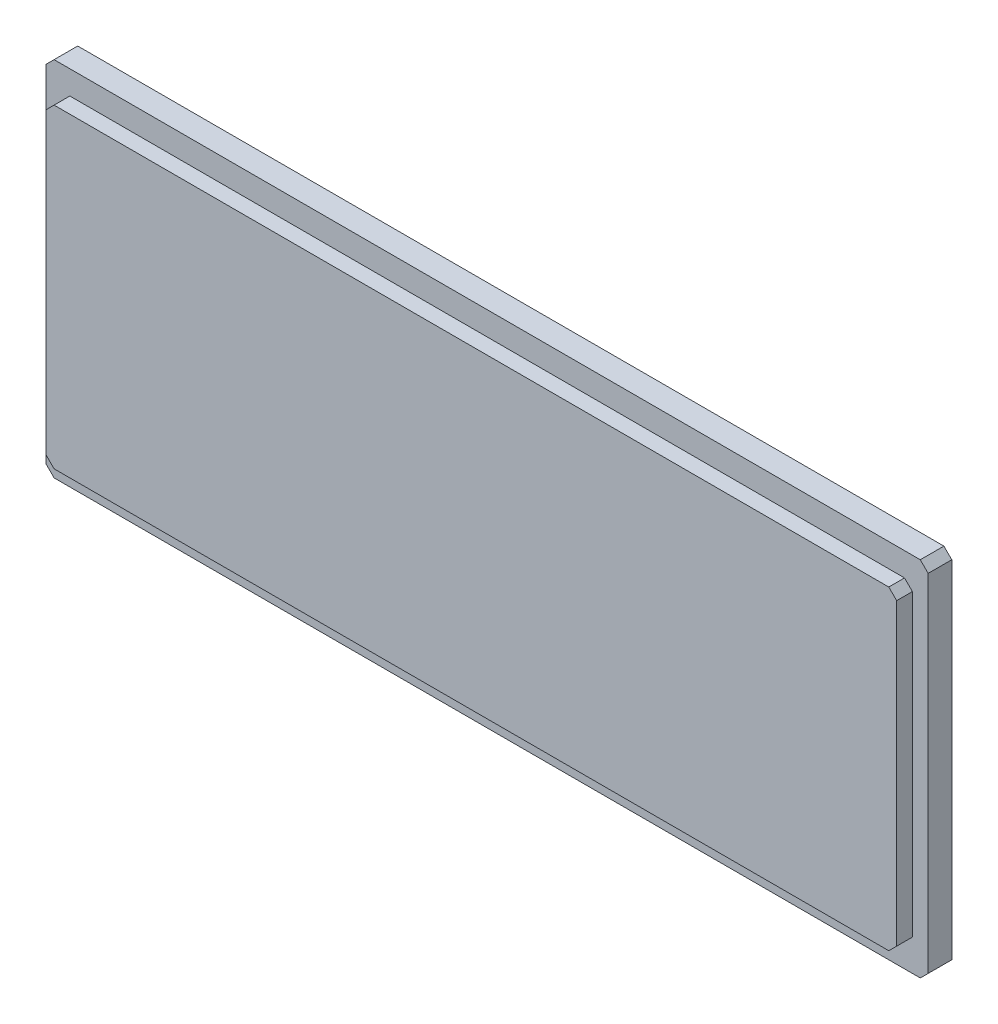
ISO-10303-21;
HEADER;
FILE_DESCRIPTION(('STEP AP214'),'2;1');
FILE_NAME('part.step','',(''),(''),'','','');
FILE_SCHEMA(('AUTOMOTIVE_DESIGN { 1 0 10303 214 1 1 1 1 }'));
ENDSEC;
DATA;
#1=APPLICATION_CONTEXT('core data for automotive mechanical design processes');
#2=APPLICATION_PROTOCOL_DEFINITION('international standard','automotive_design',2000,#1);
#3=PRODUCT_CONTEXT('',#1,'mechanical');
#4=PRODUCT('Part','Part','',(#3));
#5=PRODUCT_RELATED_PRODUCT_CATEGORY('part','',(#4));
#6=PRODUCT_DEFINITION_FORMATION('','',#4);
#7=PRODUCT_DEFINITION_CONTEXT('part definition',#1,'design');
#8=PRODUCT_DEFINITION('design','',#6,#7);
#9=PRODUCT_DEFINITION_SHAPE('','',#8);
#10=(LENGTH_UNIT() NAMED_UNIT(*) SI_UNIT(.MILLI.,.METRE.));
#11=(NAMED_UNIT(*) PLANE_ANGLE_UNIT() SI_UNIT($,.RADIAN.));
#12=(NAMED_UNIT(*) SI_UNIT($,.STERADIAN.) SOLID_ANGLE_UNIT());
#13=UNCERTAINTY_MEASURE_WITH_UNIT(LENGTH_MEASURE(1.E-05),#10,'distance_accuracy_value','');
#14=(GEOMETRIC_REPRESENTATION_CONTEXT(3) GLOBAL_UNCERTAINTY_ASSIGNED_CONTEXT((#13)) GLOBAL_UNIT_ASSIGNED_CONTEXT((#10,
#11,#12)) REPRESENTATION_CONTEXT('',''));
#15=CARTESIAN_POINT('',(0.,0.,0.));
#16=DIRECTION('',(0.,0.,1.));
#17=DIRECTION('',(1.,0.,0.));
#18=AXIS2_PLACEMENT_3D('',#15,#16,#17);
#19=CARTESIAN_POINT('',(-41.,40.,1.5));
#20=DIRECTION('',(0.,0.,1.));
#21=DIRECTION('',(1.,0.,0.));
#22=AXIS2_PLACEMENT_3D('',#19,#20,#21);
#23=PLANE('',#22);
#24=DIRECTION('',(-1.,0.,0.));
#25=VECTOR('',#24,1.);
#26=CARTESIAN_POINT('',(-41.,40.,1.5));
#27=LINE('',#26,#25);
#28=CARTESIAN_POINT('',(14.5,40.,1.5));
#29=VERTEX_POINT('',#28);
#30=CARTESIAN_POINT('',(-40.5,40.,1.5));
#31=VERTEX_POINT('',#30);
#32=EDGE_CURVE('E172',#29,#31,#27,.T.);
#33=ORIENTED_EDGE('',*,*,#32,.T.);
#34=DIRECTION('',(0.707106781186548,0.707106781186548,0.));
#35=VECTOR('',#34,1.);
#36=CARTESIAN_POINT('',(-40.75,39.75,1.5));
#37=LINE('',#36,#35);
#38=CARTESIAN_POINT('',(-41.,39.5,1.5));
#39=VERTEX_POINT('',#38);
#40=EDGE_CURVE('E224',#31,#39,#37,.F.);
#41=ORIENTED_EDGE('',*,*,#40,.T.);
#42=DIRECTION('',(0.,-1.,0.));
#43=VECTOR('',#42,1.);
#44=CARTESIAN_POINT('',(-41.,40.,1.5));
#45=LINE('',#44,#43);
#46=CARTESIAN_POINT('',(-41.,17.5,1.5));
#47=VERTEX_POINT('',#46);
#48=EDGE_CURVE('E189',#39,#47,#45,.T.);
#49=ORIENTED_EDGE('',*,*,#48,.T.);
#50=DIRECTION('',(-0.707106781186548,0.707106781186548,0.));
#51=VECTOR('',#50,1.);
#52=CARTESIAN_POINT('',(-52.25,28.75,1.5));
#53=LINE('',#52,#51);
#54=CARTESIAN_POINT('',(-40.5,17.,1.5));
#55=VERTEX_POINT('',#54);
#56=EDGE_CURVE('E198',#47,#55,#53,.F.);
#57=ORIENTED_EDGE('',*,*,#56,.T.);
#58=DIRECTION('',(1.,0.,0.));
#59=VECTOR('',#58,1.);
#60=CARTESIAN_POINT('',(-41.,17.,1.5));
#61=LINE('',#60,#59);
#62=CARTESIAN_POINT('',(14.5,17.,1.5));
#63=VERTEX_POINT('',#62);
#64=EDGE_CURVE('E171',#55,#63,#61,.T.);
#65=ORIENTED_EDGE('',*,*,#64,.T.);
#66=DIRECTION('',(-0.707106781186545,-0.70710678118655,0.));
#67=VECTOR('',#66,1.);
#68=CARTESIAN_POINT('',(-1.74999999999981,0.750000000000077,1.5));
#69=LINE('',#68,#67);
#70=CARTESIAN_POINT('',(15.,17.5,1.5));
#71=VERTEX_POINT('',#70);
#72=EDGE_CURVE('E206',#63,#71,#69,.F.);
#73=ORIENTED_EDGE('',*,*,#72,.T.);
#74=DIRECTION('',(0.,1.,0.));
#75=VECTOR('',#74,1.);
#76=CARTESIAN_POINT('',(15.,40.,1.5));
#77=LINE('',#76,#75);
#78=CARTESIAN_POINT('',(15.,39.5,1.5));
#79=VERTEX_POINT('',#78);
#80=EDGE_CURVE('E192',#71,#79,#77,.T.);
#81=ORIENTED_EDGE('',*,*,#80,.T.);
#82=DIRECTION('',(0.707106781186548,-0.707106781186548,0.));
#83=VECTOR('',#82,1.);
#84=CARTESIAN_POINT('',(-13.25,67.75,1.5));
#85=LINE('',#84,#83);
#86=EDGE_CURVE('E215',#79,#29,#85,.F.);
#87=ORIENTED_EDGE('',*,*,#86,.T.);
#88=EDGE_LOOP('',(#33,#41,#49,#57,#65,#73,#81,#87));
#89=FACE_BOUND('',#88,.T.);
#90=DIRECTION('',(1.,0.,0.));
#91=VECTOR('',#90,1.);
#92=CARTESIAN_POINT('',(-40.,18.5,1.5));
#93=LINE('',#92,#91);
#94=CARTESIAN_POINT('',(-39.5,18.5,1.5));
#95=VERTEX_POINT('',#94);
#96=CARTESIAN_POINT('',(13.5,18.5,1.5));
#97=VERTEX_POINT('',#96);
#98=EDGE_CURVE('E375',#95,#97,#93,.T.);
#99=ORIENTED_EDGE('',*,*,#98,.F.);
#100=DIRECTION('',(0.707106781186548,-0.707106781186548,0.));
#101=VECTOR('',#100,1.);
#102=CARTESIAN_POINT('',(-39.5,18.5,1.5));
#103=LINE('',#102,#101);
#104=CARTESIAN_POINT('',(-40.,19.,1.5));
#105=VERTEX_POINT('',#104);
#106=EDGE_CURVE('E11',#95,#105,#103,.F.);
#107=ORIENTED_EDGE('',*,*,#106,.T.);
#108=DIRECTION('',(0.,-1.,0.));
#109=VECTOR('',#108,1.);
#110=CARTESIAN_POINT('',(-40.,38.5,1.5));
#111=LINE('',#110,#109);
#112=CARTESIAN_POINT('',(-40.,38.,1.5));
#113=VERTEX_POINT('',#112);
#114=EDGE_CURVE('E377',#113,#105,#111,.T.);
#115=ORIENTED_EDGE('',*,*,#114,.F.);
#116=DIRECTION('',(-0.707106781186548,-0.707106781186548,0.));
#117=VECTOR('',#116,1.);
#118=CARTESIAN_POINT('',(-40.,38.,1.5));
#119=LINE('',#118,#117);
#120=CARTESIAN_POINT('',(-39.5,38.5,1.5));
#121=VERTEX_POINT('',#120);
#122=EDGE_CURVE('E253',#113,#121,#119,.F.);
#123=ORIENTED_EDGE('',*,*,#122,.T.);
#124=DIRECTION('',(-1.,0.,0.));
#125=VECTOR('',#124,1.);
#126=CARTESIAN_POINT('',(-40.,38.5,1.5));
#127=LINE('',#126,#125);
#128=CARTESIAN_POINT('',(13.5,38.5,1.5));
#129=VERTEX_POINT('',#128);
#130=EDGE_CURVE('E370',#129,#121,#127,.T.);
#131=ORIENTED_EDGE('',*,*,#130,.F.);
#132=DIRECTION('',(-0.707106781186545,0.70710678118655,0.));
#133=VECTOR('',#132,1.);
#134=CARTESIAN_POINT('',(13.5,38.5,1.5));
#135=LINE('',#134,#133);
#136=CARTESIAN_POINT('',(14.,38.,1.5));
#137=VERTEX_POINT('',#136);
#138=EDGE_CURVE('E244',#129,#137,#135,.F.);
#139=ORIENTED_EDGE('',*,*,#138,.T.);
#140=DIRECTION('',(0.,1.,0.));
#141=VECTOR('',#140,1.);
#142=CARTESIAN_POINT('',(14.,38.5,1.5));
#143=LINE('',#142,#141);
#144=CARTESIAN_POINT('',(14.,19.,1.5));
#145=VERTEX_POINT('',#144);
#146=EDGE_CURVE('E372',#145,#137,#143,.T.);
#147=ORIENTED_EDGE('',*,*,#146,.F.);
#148=DIRECTION('',(0.707106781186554,0.707106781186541,0.));
#149=VECTOR('',#148,1.);
#150=CARTESIAN_POINT('',(14.,19.,1.5));
#151=LINE('',#150,#149);
#152=EDGE_CURVE('E234',#145,#97,#151,.F.);
#153=ORIENTED_EDGE('',*,*,#152,.T.);
#154=EDGE_LOOP('',(#99,#107,#115,#123,#131,#139,#147,#153));
#155=FACE_BOUND('',#154,.T.);
#156=ADVANCED_FACE('F39',(#89,#155),#23,.T.);
#157=CARTESIAN_POINT('',(-41.,40.,1.5));
#158=DIRECTION('',(1.,0.,0.));
#159=DIRECTION('',(0.,0.,-1.));
#160=AXIS2_PLACEMENT_3D('',#157,#158,#159);
#161=PLANE('',#160);
#162=ORIENTED_EDGE('',*,*,#48,.F.);
#163=DIRECTION('',(0.,0.,-1.));
#164=VECTOR('',#163,1.);
#165=CARTESIAN_POINT('',(-41.,39.5,1.5));
#166=LINE('',#165,#164);
#167=CARTESIAN_POINT('',(-41.,39.5,0.));
#168=VERTEX_POINT('',#167);
#169=EDGE_CURVE('E217',#39,#168,#166,.T.);
#170=ORIENTED_EDGE('',*,*,#169,.T.);
#171=DIRECTION('',(0.,-1.,0.));
#172=VECTOR('',#171,1.);
#173=CARTESIAN_POINT('',(-41.,40.,0.));
#174=LINE('',#173,#172);
#175=CARTESIAN_POINT('',(-41.,17.5,0.));
#176=VERTEX_POINT('',#175);
#177=EDGE_CURVE('E178',#168,#176,#174,.T.);
#178=ORIENTED_EDGE('',*,*,#177,.T.);
#179=DIRECTION('',(0.,0.,1.));
#180=VECTOR('',#179,1.);
#181=CARTESIAN_POINT('',(-41.,17.5,1.5));
#182=LINE('',#181,#180);
#183=EDGE_CURVE('E159',#176,#47,#182,.T.);
#184=ORIENTED_EDGE('',*,*,#183,.T.);
#185=EDGE_LOOP('',(#162,#170,#178,#184));
#186=FACE_BOUND('',#185,.T.);
#187=ADVANCED_FACE('F41',(#186),#161,.F.);
#188=CARTESIAN_POINT('',(-41.,17.,1.5));
#189=DIRECTION('',(0.,1.,0.));
#190=DIRECTION('',(-1.,0.,0.));
#191=AXIS2_PLACEMENT_3D('',#188,#189,#190);
#192=PLANE('',#191);
#193=DIRECTION('',(1.,0.,0.));
#194=VECTOR('',#193,1.);
#195=CARTESIAN_POINT('',(-41.,17.,0.));
#196=LINE('',#195,#194);
#197=CARTESIAN_POINT('',(-40.5,17.,0.));
#198=VERTEX_POINT('',#197);
#199=CARTESIAN_POINT('',(14.5,17.,0.));
#200=VERTEX_POINT('',#199);
#201=EDGE_CURVE('E168',#198,#200,#196,.T.);
#202=ORIENTED_EDGE('',*,*,#201,.T.);
#203=DIRECTION('',(0.,0.,1.));
#204=VECTOR('',#203,1.);
#205=CARTESIAN_POINT('',(14.5,17.,1.5));
#206=LINE('',#205,#204);
#207=EDGE_CURVE('E204',#200,#63,#206,.T.);
#208=ORIENTED_EDGE('',*,*,#207,.T.);
#209=ORIENTED_EDGE('',*,*,#64,.F.);
#210=DIRECTION('',(0.,0.,-1.));
#211=VECTOR('',#210,1.);
#212=CARTESIAN_POINT('',(-40.5,17.,1.5));
#213=LINE('',#212,#211);
#214=EDGE_CURVE('E157',#55,#198,#213,.T.);
#215=ORIENTED_EDGE('',*,*,#214,.T.);
#216=EDGE_LOOP('',(#202,#208,#209,#215));
#217=FACE_BOUND('',#216,.T.);
#218=ADVANCED_FACE('F167',(#217),#192,.F.);
#219=CARTESIAN_POINT('',(15.,40.,1.5));
#220=DIRECTION('',(-1.,0.,0.));
#221=DIRECTION('',(0.,-1.,0.));
#222=AXIS2_PLACEMENT_3D('',#219,#220,#221);
#223=PLANE('',#222);
#224=DIRECTION('',(0.,1.,0.));
#225=VECTOR('',#224,1.);
#226=CARTESIAN_POINT('',(15.,40.,0.));
#227=LINE('',#226,#225);
#228=CARTESIAN_POINT('',(15.,17.5,0.));
#229=VERTEX_POINT('',#228);
#230=CARTESIAN_POINT('',(15.,39.5,0.));
#231=VERTEX_POINT('',#230);
#232=EDGE_CURVE('E177',#229,#231,#227,.T.);
#233=ORIENTED_EDGE('',*,*,#232,.T.);
#234=DIRECTION('',(0.,0.,1.));
#235=VECTOR('',#234,1.);
#236=CARTESIAN_POINT('',(15.,39.5,1.5));
#237=LINE('',#236,#235);
#238=EDGE_CURVE('E213',#231,#79,#237,.T.);
#239=ORIENTED_EDGE('',*,*,#238,.T.);
#240=ORIENTED_EDGE('',*,*,#80,.F.);
#241=DIRECTION('',(0.,0.,-1.));
#242=VECTOR('',#241,1.);
#243=CARTESIAN_POINT('',(15.,17.5,1.5));
#244=LINE('',#243,#242);
#245=EDGE_CURVE('E200',#71,#229,#244,.T.);
#246=ORIENTED_EDGE('',*,*,#245,.T.);
#247=EDGE_LOOP('',(#233,#239,#240,#246));
#248=FACE_BOUND('',#247,.T.);
#249=ADVANCED_FACE('F297',(#248),#223,.F.);
#250=CARTESIAN_POINT('',(-41.,40.,1.5));
#251=DIRECTION('',(0.,-1.,0.));
#252=DIRECTION('',(0.,0.,-1.));
#253=AXIS2_PLACEMENT_3D('',#250,#251,#252);
#254=PLANE('',#253);
#255=DIRECTION('',(-1.,0.,0.));
#256=VECTOR('',#255,1.);
#257=CARTESIAN_POINT('',(-41.,40.,0.));
#258=LINE('',#257,#256);
#259=CARTESIAN_POINT('',(14.5,40.,0.));
#260=VERTEX_POINT('',#259);
#261=CARTESIAN_POINT('',(-40.5,40.,0.));
#262=VERTEX_POINT('',#261);
#263=EDGE_CURVE('E181',#260,#262,#258,.T.);
#264=ORIENTED_EDGE('',*,*,#263,.T.);
#265=DIRECTION('',(0.,0.,1.));
#266=VECTOR('',#265,1.);
#267=CARTESIAN_POINT('',(-40.5,40.,1.5));
#268=LINE('',#267,#266);
#269=EDGE_CURVE('E222',#262,#31,#268,.T.);
#270=ORIENTED_EDGE('',*,*,#269,.T.);
#271=ORIENTED_EDGE('',*,*,#32,.F.);
#272=DIRECTION('',(0.,0.,-1.));
#273=VECTOR('',#272,1.);
#274=CARTESIAN_POINT('',(14.5,40.,1.5));
#275=LINE('',#274,#273);
#276=EDGE_CURVE('E208',#29,#260,#275,.T.);
#277=ORIENTED_EDGE('',*,*,#276,.T.);
#278=EDGE_LOOP('',(#264,#270,#271,#277));
#279=FACE_BOUND('',#278,.T.);
#280=ADVANCED_FACE('F294',(#279),#254,.F.);
#281=CARTESIAN_POINT('',(-41.,40.,0.));
#282=DIRECTION('',(0.,0.,1.));
#283=DIRECTION('',(1.,0.,0.));
#284=AXIS2_PLACEMENT_3D('',#281,#282,#283);
#285=PLANE('',#284);
#286=ORIENTED_EDGE('',*,*,#177,.F.);
#287=DIRECTION('',(-0.707106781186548,-0.707106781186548,0.));
#288=VECTOR('',#287,1.);
#289=CARTESIAN_POINT('',(-41.,39.5,0.));
#290=LINE('',#289,#288);
#291=EDGE_CURVE('E220',#168,#262,#290,.F.);
#292=ORIENTED_EDGE('',*,*,#291,.T.);
#293=ORIENTED_EDGE('',*,*,#263,.F.);
#294=DIRECTION('',(-0.707106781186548,0.707106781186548,0.));
#295=VECTOR('',#294,1.);
#296=CARTESIAN_POINT('',(14.5,40.,0.));
#297=LINE('',#296,#295);
#298=EDGE_CURVE('E211',#260,#231,#297,.F.);
#299=ORIENTED_EDGE('',*,*,#298,.T.);
#300=ORIENTED_EDGE('',*,*,#232,.F.);
#301=DIRECTION('',(0.707106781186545,0.70710678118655,0.));
#302=VECTOR('',#301,1.);
#303=CARTESIAN_POINT('',(15.,17.5,0.));
#304=LINE('',#303,#302);
#305=EDGE_CURVE('E176',#229,#200,#304,.F.);
#306=ORIENTED_EDGE('',*,*,#305,.T.);
#307=ORIENTED_EDGE('',*,*,#201,.F.);
#308=DIRECTION('',(0.707106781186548,-0.707106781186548,0.));
#309=VECTOR('',#308,1.);
#310=CARTESIAN_POINT('',(-40.5,17.,0.));
#311=LINE('',#310,#309);
#312=EDGE_CURVE('E153',#198,#176,#311,.F.);
#313=ORIENTED_EDGE('',*,*,#312,.T.);
#314=EDGE_LOOP('',(#286,#292,#293,#299,#300,#306,#307,#313));
#315=FACE_BOUND('',#314,.T.);
#316=ADVANCED_FACE('F174',(#315),#285,.F.);
#317=CARTESIAN_POINT('',(-40.,38.5,2.5));
#318=DIRECTION('',(1.,0.,0.));
#319=DIRECTION('',(0.,0.,-1.));
#320=AXIS2_PLACEMENT_3D('',#317,#318,#319);
#321=PLANE('',#320);
#322=ORIENTED_EDGE('',*,*,#114,.T.);
#323=DIRECTION('',(0.,0.,1.));
#324=VECTOR('',#323,1.);
#325=CARTESIAN_POINT('',(-40.,19.,2.5));
#326=LINE('',#325,#324);
#327=CARTESIAN_POINT('',(-40.,19.,2.5));
#328=VERTEX_POINT('',#327);
#329=EDGE_CURVE('E59',#105,#328,#326,.T.);
#330=ORIENTED_EDGE('',*,*,#329,.T.);
#331=DIRECTION('',(0.,-1.,0.));
#332=VECTOR('',#331,1.);
#333=CARTESIAN_POINT('',(-40.,38.5,2.5));
#334=LINE('',#333,#332);
#335=CARTESIAN_POINT('',(-40.,38.,2.5));
#336=VERTEX_POINT('',#335);
#337=EDGE_CURVE('E263',#336,#328,#334,.T.);
#338=ORIENTED_EDGE('',*,*,#337,.F.);
#339=DIRECTION('',(0.,0.,-1.));
#340=VECTOR('',#339,1.);
#341=CARTESIAN_POINT('',(-40.,38.,2.5));
#342=LINE('',#341,#340);
#343=EDGE_CURVE('E246',#336,#113,#342,.T.);
#344=ORIENTED_EDGE('',*,*,#343,.T.);
#345=EDGE_LOOP('',(#322,#330,#338,#344));
#346=FACE_BOUND('',#345,.T.);
#347=ADVANCED_FACE('F314',(#346),#321,.F.);
#348=CARTESIAN_POINT('',(-40.,18.5,2.5));
#349=DIRECTION('',(0.,1.,0.));
#350=DIRECTION('',(0.,0.,1.));
#351=AXIS2_PLACEMENT_3D('',#348,#349,#350);
#352=PLANE('',#351);
#353=DIRECTION('',(1.,0.,0.));
#354=VECTOR('',#353,1.);
#355=CARTESIAN_POINT('',(-40.,18.5,2.5));
#356=LINE('',#355,#354);
#357=CARTESIAN_POINT('',(-39.5,18.5,2.5));
#358=VERTEX_POINT('',#357);
#359=CARTESIAN_POINT('',(13.5,18.5,2.5));
#360=VERTEX_POINT('',#359);
#361=EDGE_CURVE('E262',#358,#360,#356,.T.);
#362=ORIENTED_EDGE('',*,*,#361,.F.);
#363=DIRECTION('',(0.,0.,-1.));
#364=VECTOR('',#363,1.);
#365=CARTESIAN_POINT('',(-39.5,18.5,2.5));
#366=LINE('',#365,#364);
#367=EDGE_CURVE('E255',#358,#95,#366,.T.);
#368=ORIENTED_EDGE('',*,*,#367,.T.);
#369=ORIENTED_EDGE('',*,*,#98,.T.);
#370=DIRECTION('',(0.,0.,1.));
#371=VECTOR('',#370,1.);
#372=CARTESIAN_POINT('',(13.5,18.5,2.5));
#373=LINE('',#372,#371);
#374=EDGE_CURVE('E229',#97,#360,#373,.T.);
#375=ORIENTED_EDGE('',*,*,#374,.T.);
#376=EDGE_LOOP('',(#362,#368,#369,#375));
#377=FACE_BOUND('',#376,.T.);
#378=ADVANCED_FACE('F267',(#377),#352,.F.);
#379=CARTESIAN_POINT('',(14.,38.5,2.5));
#380=DIRECTION('',(-1.,0.,0.));
#381=DIRECTION('',(0.,-1.,0.));
#382=AXIS2_PLACEMENT_3D('',#379,#380,#381);
#383=PLANE('',#382);
#384=ORIENTED_EDGE('',*,*,#146,.T.);
#385=DIRECTION('',(0.,0.,1.));
#386=VECTOR('',#385,1.);
#387=CARTESIAN_POINT('',(14.,38.,2.5));
#388=LINE('',#387,#386);
#389=CARTESIAN_POINT('',(14.,38.,2.5));
#390=VERTEX_POINT('',#389);
#391=EDGE_CURVE('E240',#137,#390,#388,.T.);
#392=ORIENTED_EDGE('',*,*,#391,.T.);
#393=DIRECTION('',(0.,1.,0.));
#394=VECTOR('',#393,1.);
#395=CARTESIAN_POINT('',(14.,38.5,2.5));
#396=LINE('',#395,#394);
#397=CARTESIAN_POINT('',(14.,19.,2.5));
#398=VERTEX_POINT('',#397);
#399=EDGE_CURVE('E270',#398,#390,#396,.T.);
#400=ORIENTED_EDGE('',*,*,#399,.F.);
#401=DIRECTION('',(0.,0.,-1.));
#402=VECTOR('',#401,1.);
#403=CARTESIAN_POINT('',(14.,19.,2.5));
#404=LINE('',#403,#402);
#405=EDGE_CURVE('E226',#398,#145,#404,.T.);
#406=ORIENTED_EDGE('',*,*,#405,.T.);
#407=EDGE_LOOP('',(#384,#392,#400,#406));
#408=FACE_BOUND('',#407,.T.);
#409=ADVANCED_FACE('F322',(#408),#383,.F.);
#410=CARTESIAN_POINT('',(-40.,38.5,2.5));
#411=DIRECTION('',(0.,-1.,0.));
#412=DIRECTION('',(1.,0.,0.));
#413=AXIS2_PLACEMENT_3D('',#410,#411,#412);
#414=PLANE('',#413);
#415=ORIENTED_EDGE('',*,*,#130,.T.);
#416=DIRECTION('',(0.,0.,1.));
#417=VECTOR('',#416,1.);
#418=CARTESIAN_POINT('',(-39.5,38.5,2.5));
#419=LINE('',#418,#417);
#420=CARTESIAN_POINT('',(-39.5,38.5,2.5));
#421=VERTEX_POINT('',#420);
#422=EDGE_CURVE('E249',#121,#421,#419,.T.);
#423=ORIENTED_EDGE('',*,*,#422,.T.);
#424=DIRECTION('',(-1.,0.,0.));
#425=VECTOR('',#424,1.);
#426=CARTESIAN_POINT('',(-40.,38.5,2.5));
#427=LINE('',#426,#425);
#428=CARTESIAN_POINT('',(13.5,38.5,2.5));
#429=VERTEX_POINT('',#428);
#430=EDGE_CURVE('E183',#429,#421,#427,.T.);
#431=ORIENTED_EDGE('',*,*,#430,.F.);
#432=DIRECTION('',(0.,0.,-1.));
#433=VECTOR('',#432,1.);
#434=CARTESIAN_POINT('',(13.5,38.5,2.5));
#435=LINE('',#434,#433);
#436=EDGE_CURVE('E237',#429,#129,#435,.T.);
#437=ORIENTED_EDGE('',*,*,#436,.T.);
#438=EDGE_LOOP('',(#415,#423,#431,#437));
#439=FACE_BOUND('',#438,.T.);
#440=ADVANCED_FACE('F327',(#439),#414,.F.);
#441=CARTESIAN_POINT('',(-40.,18.5,2.5));
#442=DIRECTION('',(0.,0.,1.));
#443=DIRECTION('',(1.,0.,0.));
#444=AXIS2_PLACEMENT_3D('',#441,#442,#443);
#445=PLANE('',#444);
#446=ORIENTED_EDGE('',*,*,#337,.T.);
#447=DIRECTION('',(-0.707106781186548,0.707106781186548,0.));
#448=VECTOR('',#447,1.);
#449=CARTESIAN_POINT('',(-39.75,18.75,2.5));
#450=LINE('',#449,#448);
#451=EDGE_CURVE('E47',#328,#358,#450,.F.);
#452=ORIENTED_EDGE('',*,*,#451,.T.);
#453=ORIENTED_EDGE('',*,*,#361,.T.);
#454=DIRECTION('',(-0.707106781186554,-0.707106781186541,0.));
#455=VECTOR('',#454,1.);
#456=CARTESIAN_POINT('',(-13.2500000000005,-8.25000000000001,2.5));
#457=LINE('',#456,#455);
#458=EDGE_CURVE('E232',#360,#398,#457,.F.);
#459=ORIENTED_EDGE('',*,*,#458,.T.);
#460=ORIENTED_EDGE('',*,*,#399,.T.);
#461=DIRECTION('',(0.707106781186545,-0.70710678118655,0.));
#462=VECTOR('',#461,1.);
#463=CARTESIAN_POINT('',(-3.24999999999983,55.2499999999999,2.5));
#464=LINE('',#463,#462);
#465=EDGE_CURVE('E242',#390,#429,#464,.F.);
#466=ORIENTED_EDGE('',*,*,#465,.T.);
#467=ORIENTED_EDGE('',*,*,#430,.T.);
#468=DIRECTION('',(0.707106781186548,0.707106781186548,0.));
#469=VECTOR('',#468,1.);
#470=CARTESIAN_POINT('',(-49.75,28.25,2.5));
#471=LINE('',#470,#469);
#472=EDGE_CURVE('E251',#421,#336,#471,.F.);
#473=ORIENTED_EDGE('',*,*,#472,.T.);
#474=EDGE_LOOP('',(#446,#452,#453,#459,#460,#466,#467,#473));
#475=FACE_BOUND('',#474,.T.);
#476=ADVANCED_FACE('F261',(#475),#445,.T.);
#477=CARTESIAN_POINT('',(-40.5,17.,1.5));
#478=DIRECTION('',(0.707106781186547,0.707106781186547,0.));
#479=DIRECTION('',(-0.707106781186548,0.707106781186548,0.));
#480=AXIS2_PLACEMENT_3D('',#477,#478,#479);
#481=PLANE('',#480);
#482=ORIENTED_EDGE('',*,*,#56,.F.);
#483=ORIENTED_EDGE('',*,*,#183,.F.);
#484=ORIENTED_EDGE('',*,*,#312,.F.);
#485=ORIENTED_EDGE('',*,*,#214,.F.);
#486=EDGE_LOOP('',(#482,#483,#484,#485));
#487=FACE_BOUND('',#486,.T.);
#488=ADVANCED_FACE('F156',(#487),#481,.F.);
#489=CARTESIAN_POINT('',(15.,17.5,1.5));
#490=DIRECTION('',(-0.70710678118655,0.707106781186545,0.));
#491=DIRECTION('',(-0.707106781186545,-0.70710678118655,0.));
#492=AXIS2_PLACEMENT_3D('',#489,#490,#491);
#493=PLANE('',#492);
#494=ORIENTED_EDGE('',*,*,#72,.F.);
#495=ORIENTED_EDGE('',*,*,#207,.F.);
#496=ORIENTED_EDGE('',*,*,#305,.F.);
#497=ORIENTED_EDGE('',*,*,#245,.F.);
#498=EDGE_LOOP('',(#494,#495,#496,#497));
#499=FACE_BOUND('',#498,.T.);
#500=ADVANCED_FACE('F336',(#499),#493,.F.);
#501=CARTESIAN_POINT('',(14.5,40.,1.5));
#502=DIRECTION('',(-0.707106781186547,-0.707106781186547,0.));
#503=DIRECTION('',(0.707106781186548,-0.707106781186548,0.));
#504=AXIS2_PLACEMENT_3D('',#501,#502,#503);
#505=PLANE('',#504);
#506=ORIENTED_EDGE('',*,*,#86,.F.);
#507=ORIENTED_EDGE('',*,*,#238,.F.);
#508=ORIENTED_EDGE('',*,*,#298,.F.);
#509=ORIENTED_EDGE('',*,*,#276,.F.);
#510=EDGE_LOOP('',(#506,#507,#508,#509));
#511=FACE_BOUND('',#510,.T.);
#512=ADVANCED_FACE('F339',(#511),#505,.F.);
#513=CARTESIAN_POINT('',(-41.,39.5,1.5));
#514=DIRECTION('',(0.707106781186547,-0.707106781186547,0.));
#515=DIRECTION('',(0.707106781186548,0.707106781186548,0.));
#516=AXIS2_PLACEMENT_3D('',#513,#514,#515);
#517=PLANE('',#516);
#518=ORIENTED_EDGE('',*,*,#40,.F.);
#519=ORIENTED_EDGE('',*,*,#269,.F.);
#520=ORIENTED_EDGE('',*,*,#291,.F.);
#521=ORIENTED_EDGE('',*,*,#169,.F.);
#522=EDGE_LOOP('',(#518,#519,#520,#521));
#523=FACE_BOUND('',#522,.T.);
#524=ADVANCED_FACE('F343',(#523),#517,.F.);
#525=CARTESIAN_POINT('',(14.,19.,2.5));
#526=DIRECTION('',(-0.707106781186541,0.707106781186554,0.));
#527=DIRECTION('',(-0.707106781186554,-0.707106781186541,0.));
#528=AXIS2_PLACEMENT_3D('',#525,#526,#527);
#529=PLANE('',#528);
#530=ORIENTED_EDGE('',*,*,#458,.F.);
#531=ORIENTED_EDGE('',*,*,#374,.F.);
#532=ORIENTED_EDGE('',*,*,#152,.F.);
#533=ORIENTED_EDGE('',*,*,#405,.F.);
#534=EDGE_LOOP('',(#530,#531,#532,#533));
#535=FACE_BOUND('',#534,.T.);
#536=ADVANCED_FACE('F347',(#535),#529,.F.);
#537=CARTESIAN_POINT('',(13.5,38.5,2.5));
#538=DIRECTION('',(-0.70710678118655,-0.707106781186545,0.));
#539=DIRECTION('',(0.707106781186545,-0.70710678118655,0.));
#540=AXIS2_PLACEMENT_3D('',#537,#538,#539);
#541=PLANE('',#540);
#542=ORIENTED_EDGE('',*,*,#465,.F.);
#543=ORIENTED_EDGE('',*,*,#391,.F.);
#544=ORIENTED_EDGE('',*,*,#138,.F.);
#545=ORIENTED_EDGE('',*,*,#436,.F.);
#546=EDGE_LOOP('',(#542,#543,#544,#545));
#547=FACE_BOUND('',#546,.T.);
#548=ADVANCED_FACE('F279',(#547),#541,.F.);
#549=CARTESIAN_POINT('',(-40.,38.,2.5));
#550=DIRECTION('',(0.707106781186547,-0.707106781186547,0.));
#551=DIRECTION('',(0.707106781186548,0.707106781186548,0.));
#552=AXIS2_PLACEMENT_3D('',#549,#550,#551);
#553=PLANE('',#552);
#554=ORIENTED_EDGE('',*,*,#472,.F.);
#555=ORIENTED_EDGE('',*,*,#422,.F.);
#556=ORIENTED_EDGE('',*,*,#122,.F.);
#557=ORIENTED_EDGE('',*,*,#343,.F.);
#558=EDGE_LOOP('',(#554,#555,#556,#557));
#559=FACE_BOUND('',#558,.T.);
#560=ADVANCED_FACE('F274',(#559),#553,.F.);
#561=CARTESIAN_POINT('',(-39.5,18.5,2.5));
#562=DIRECTION('',(0.707106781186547,0.707106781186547,0.));
#563=DIRECTION('',(-0.707106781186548,0.707106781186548,0.));
#564=AXIS2_PLACEMENT_3D('',#561,#562,#563);
#565=PLANE('',#564);
#566=ORIENTED_EDGE('',*,*,#451,.F.);
#567=ORIENTED_EDGE('',*,*,#329,.F.);
#568=ORIENTED_EDGE('',*,*,#106,.F.);
#569=ORIENTED_EDGE('',*,*,#367,.F.);
#570=EDGE_LOOP('',(#566,#567,#568,#569));
#571=FACE_BOUND('',#570,.T.);
#572=ADVANCED_FACE('F272',(#571),#565,.F.);
#573=CLOSED_SHELL('',(#156,#187,#218,#249,#280,#316,#347,#378,#409,#440,#476,#488,#500,#512,
#524,#536,#548,#560,#572));
#574=MANIFOLD_SOLID_BREP('B2',#573);
#575=ADVANCED_BREP_SHAPE_REPRESENTATION('',(#18,#574),#14);
#576=SHAPE_DEFINITION_REPRESENTATION(#9,#575);
ENDSEC;
END-ISO-10303-21;
